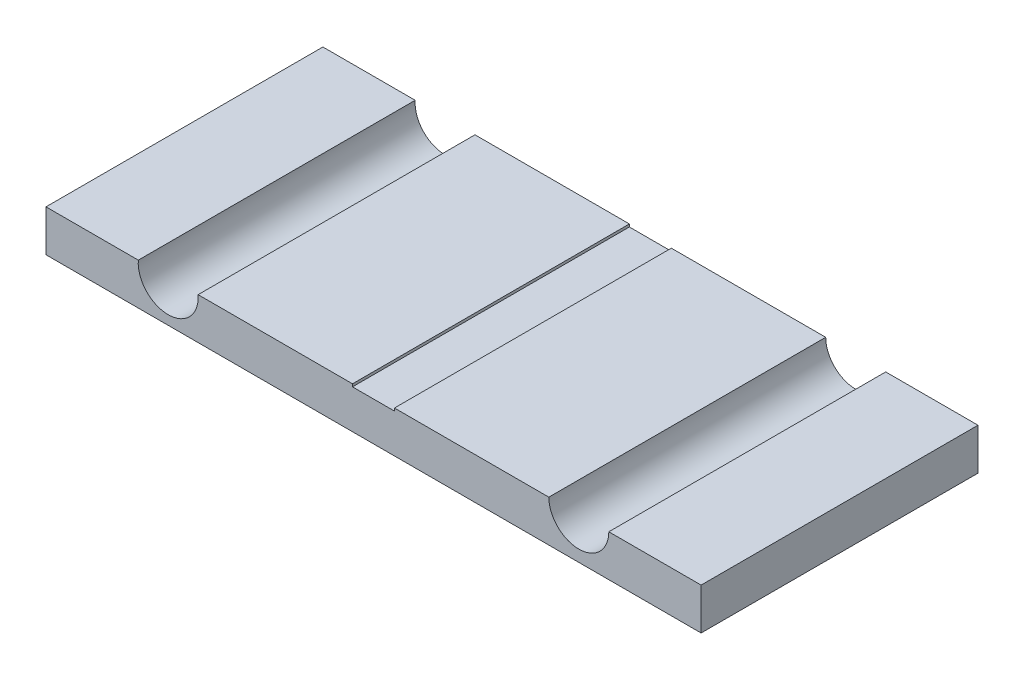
from build123d import *

# Parameters (mm, degrees)
BOSS_EXTRUDE1_DEPTH = 60


with BuildPart() as part:
    # Sketch1 → Boss-Extrude1 (new body)
    with BuildSketch(Plane.XY):
        with BuildLine():
            Line((0.849108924, -3.965414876), (34.304108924, -3.965414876))
            Line((34.304108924, -3.965414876), (34.304108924, -4.540414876))
            Line((34.304108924, -4.540414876), (43.394108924, -4.540414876))
            Line((43.394108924, -4.540414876), (43.394108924, -3.965414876))
            Line((43.394108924, -3.965414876), (76.849108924, -3.965414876))
            ThreePointArc((76.849108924, -3.965414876), (83.349108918, -10.465123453), (89.849108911, -3.965414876))
            Line((89.849108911, -3.965414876), (109.849108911, -3.965414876))
            Line((109.849108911, -3.965414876), (109.849108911, -12.965414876))
            Line((109.849108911, -12.965414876), (-32.111642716, -12.965414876))
            Line((-32.111642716, -12.965414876), (-32.111642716, -3.965414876))
            Line((-32.111642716, -3.965414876), (-12.111642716, -3.965414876))
            ThreePointArc((-12.111642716, -3.965414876), (-5.631266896, -10.970121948), (0.849108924, -3.965414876))
        make_face()
    extrude(amount=-BOSS_EXTRUDE1_DEPTH)


solid = part.part
